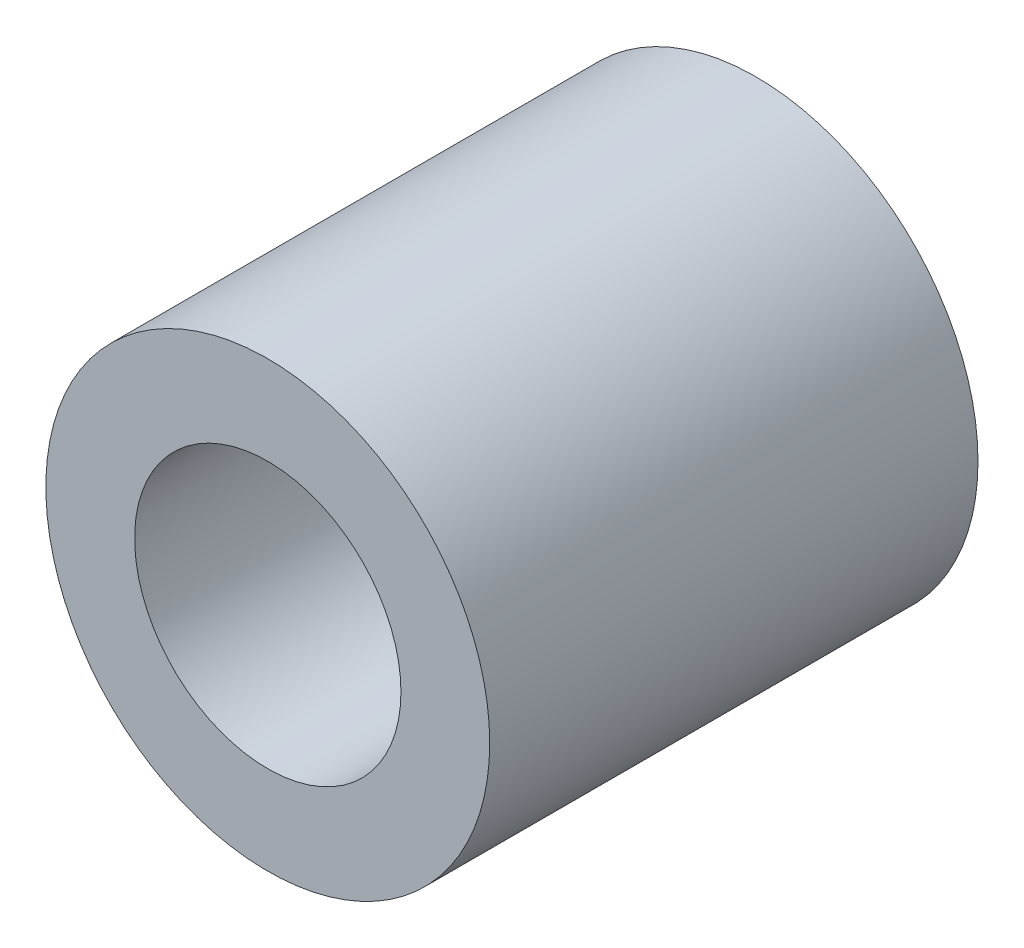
from build123d import *

# Parameters (mm, degrees)
ESQUISSE1_R      = 5
ESQUISSE1_R_2    = 3
EXTRUSION1_DEPTH = 11


with BuildPart() as part:
    # Esquisse1 → Extrusion1 (new body)
    with BuildSketch(Plane.XY):
        Circle(ESQUISSE1_R)
        Circle(ESQUISSE1_R_2, mode=Mode.SUBTRACT)
    extrude(amount=EXTRUSION1_DEPTH)


solid = part.part
